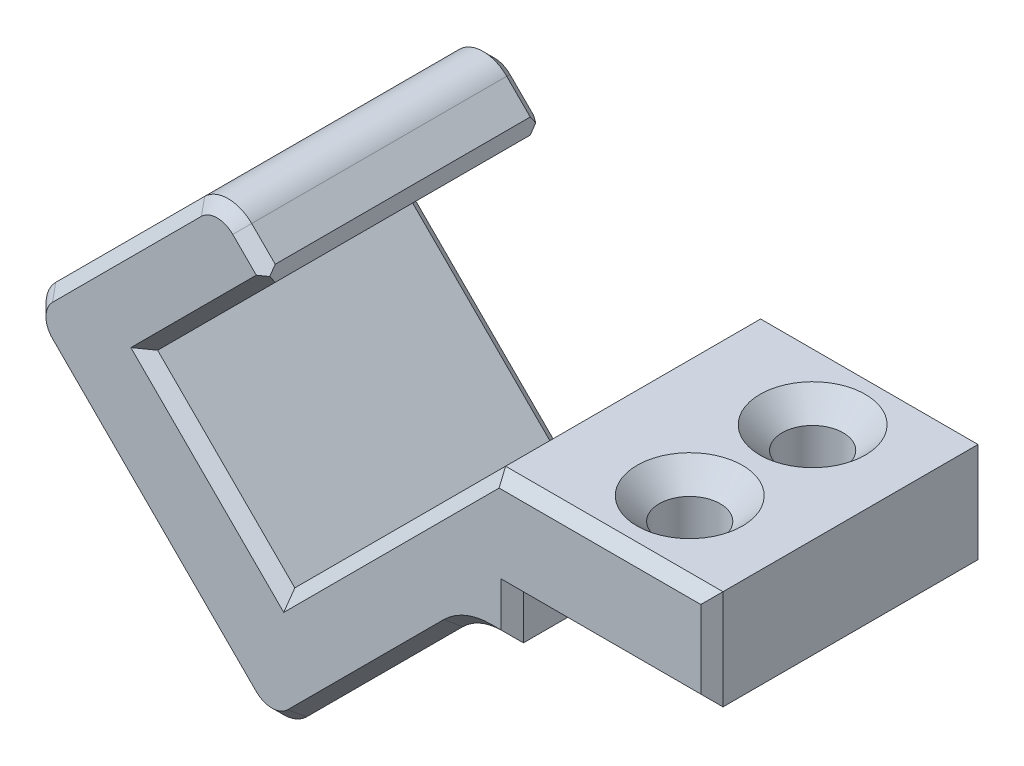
from build123d import *

# Parameters (mm, degrees)
BOSS_EXTRU_1_DEPTH      = 25
CONG_1_R                = 3
CONG_2_R                = 5
CHANFREIN1_SIZE         = 1
CHANFREIN2_SIZE         = 1
CHANFREIN3_SIZE         = 1
ESQUISSE2_R             = 1.75
ENL_V_MAT_EXTRU_2_DEPTH = 25
CHANFREIN4_SIZE         = 2
ESQUISSE3_R             = 2.75
ENL_V_MAT_EXTRU_3_DEPTH = 10
CHANFREIN5_SIZE         = 2


with BuildPart() as part:
    # Esquisse1 → Boss.-Extru.1 (new body)
    with BuildSketch(Plane.XY):
        Polygon((19.01040764, 19.01040764), (38.617009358, 19.01040764), (38.617009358, 10.01040764), (20.617009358, 10.01040764), (20.617009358, 6.01040764), (16.617009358, 6.01040764), (-1.060660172, -11.66726189), (-23.68807717, 10.960155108), (-6.01040764, 28.637824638), (-1.060660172, 23.68807717), (-12.374368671, 12.374368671), (0, 0), align=None)
    extrude(amount=BOSS_EXTRU_1_DEPTH)

    # Cong_1
    cong_1_edges = [part.edges().sort_by_distance(p)[0] for p in [
        (-1.060660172, -11.66726189, 12.5),
        (-23.68807717, 10.960155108, 12.5),
        (-6.01040764, 28.637824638, 12.5),
    ]]
    fillet(cong_1_edges, radius=CONG_1_R)

    # Cong_2
    cong_2_edges = [part.edges().sort_by_distance(p)[0] for p in [
        (16.617009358, 6.01040764, 12.5),
    ]]
    fillet(cong_2_edges, radius=CONG_2_R)

    # Chanfrein1
    chanfrein1_edges = [part.edges().sort_by_distance(p)[0] for p in [
        (-6.187184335, 6.187184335, 25),
        (-6.717514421, 18.03122292, 25),
        (-2.474873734, 25.102290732, 25),
        (-14.849242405, 19.798989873, 25),
        (20.617009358, 8.01040764, 25),
        (-12.374368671, -0.353553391, 25),
        (8.106601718, -2.5, 25),
        (-1.060660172, -10.424621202, 25),
        (-22.445436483, 10.960155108, 25),
        (-6.01040764, 27.395183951, 25),
        (29.617009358, 10.01040764, 25),
        (38.617009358, 14.51040764, 25),
        (28.813708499, 19.01040764, 25),
        (19.652543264, 6.01040764, 25),
        (16.774660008, 5.629805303, 25),
        (9.50520382, 9.50520382, 25),
    ]]
    chamfer(chanfrein1_edges, length=CHANFREIN1_SIZE)

    # Chanfrein2
    chanfrein2_edges = [part.edges().sort_by_distance(p)[0] for p in [
        (38.617009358, 14.51040764, 0),
        (29.617009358, 10.01040764, 0),
        (20.617009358, 8.01040764, 0),
        (-2.474873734, 25.102290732, 0),
        (-6.717514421, 18.03122292, 0),
        (-6.187184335, 6.187184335, 0),
        (9.50520382, 9.50520382, 0),
        (28.813708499, 19.01040764, 0),
        (-14.849242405, 19.798989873, 0),
        (8.106601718, -2.5, 0),
        (-12.374368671, -0.353553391, 0),
        (-1.060660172, -10.424621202, 0),
        (-22.445436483, 10.960155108, 0),
        (-6.01040764, 27.395183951, 0),
        (19.652543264, 6.01040764, 0),
        (16.774660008, 5.629805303, 0),
    ]]
    chamfer(chanfrein2_edges, length=CHANFREIN2_SIZE)

    # Chanfrein3
    chanfrein3_edges = [part.edges().sort_by_distance(p)[0] for p in [
        (-1.060660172, 23.68807717, 12.5),
    ]]
    chamfer(chanfrein3_edges, length=CHANFREIN3_SIZE)

    # Esquisse2 → Enl_v. mat.-Extru.2 (cut)
    with BuildSketch(Plane(origin=(5.303300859, -5.303300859, 0), x_dir=(0, 0, -1), z_dir=(0.707106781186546, -0.707106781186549, 0))):
        with Locations(Location((-12.5, 7.5, 0), (0, 0, 90))):
            Circle(ESQUISSE2_R)
    extrude(amount=-ENL_V_MAT_EXTRU_2_DEPTH, mode=Mode.SUBTRACT)

    # Chanfrein4
    chanfrein4_edges = [part.edges().sort_by_distance(p)[0] for p in [
        (9.369164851, -1.237436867, 12.5),
    ]]
    chamfer(chanfrein4_edges, length=CHANFREIN4_SIZE)

    # Esquisse3 → Enl_v. mat.-Extru.3 (cut)
    with BuildSketch(Plane(origin=(0, 19.01040764, 0), x_dir=(1, 0, 0), z_dir=(0, 1, 0))):
        with Locations(Location((29.617009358, -6.913635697, 0), (0, 0, 270))):
            Circle(ESQUISSE3_R)
        with Locations(Location((29.617009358, -18, 0), (0, 0, 270))):
            Circle(ESQUISSE3_R)
    extrude(amount=-ENL_V_MAT_EXTRU_3_DEPTH, mode=Mode.SUBTRACT)

    # Chanfrein5
    chanfrein5_edges = [part.edges().sort_by_distance(p)[0] for p in [
        (29.617009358, 19.01040764, 4.163635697),
        (29.617009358, 19.01040764, 15.25),
    ]]
    chamfer(chanfrein5_edges, length=CHANFREIN5_SIZE)


solid = part.part
